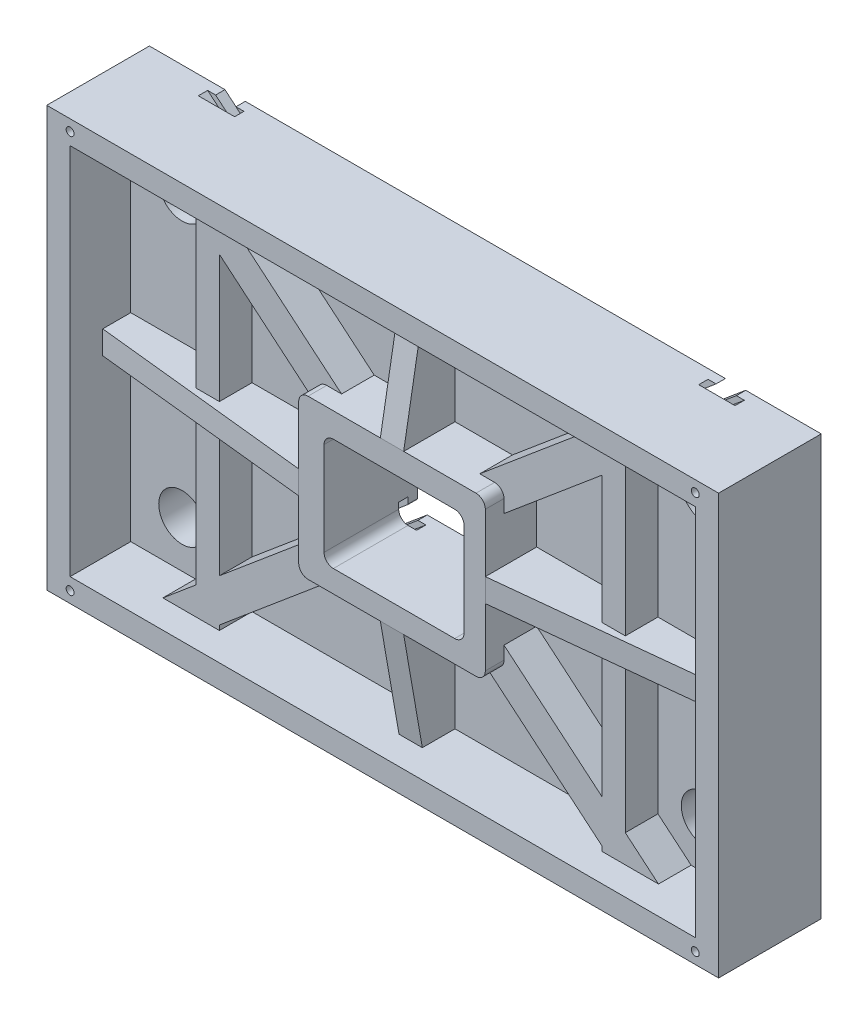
from build123d import *

# Parameters (mm, degrees)
SKETCH_1_W               = 720
SKETCH_1_H               = 450
SKETCH_1_R               = 25
EXTRUDE_1_DEPTH          = 110
SKETCH_2_W               = 670
SKETCH_2_H               = 400
CUT_EXTRUDE_1_DEPTH      = 65
EXTRUDE_2_DEPTH          = 55
EXTRUDE_3_DEPTH          = 12.5
EXTRUDE_3_DEPTH_BACK     = 12.5
EXTRUDE_4_DEPTH          = 12.5
EXTRUDE_4_DEPTH_BACK     = 12.5
SKETCH_7_W               = 35
SKETCH_7_H               = 187.5
EXTRUDE_5_DEPTH          = 25
SKETCH_8_W               = 35
SKETCH_8_H               = 187.5
EXTRUDE_6_DEPTH          = 25
CUT_EXTRUDE_2_DEPTH      = 413
CUT_EXTRUDE_2_DEPTH_BACK = 370
CUT_EXTRUDE_3_DEPTH      = 370
CUT_EXTRUDE_3_DEPTH_BACK = 370
EXTRUDE_7_DEPTH          = 35
HOLE_WIZARD_M10_1_D      = 8.5
HOLE_WIZARD_M10_1_DEPTH  = 24.5
HOLE_WIZARD_M10_1_TIP    = 2.553657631


with BuildPart() as part:
    # Sketch 1 → Extrude 1 (new body)
    with BuildSketch(Plane.XY):
        Rectangle(SKETCH_1_W, SKETCH_1_H)
        with Locations((280, -150)):
            Circle(SKETCH_1_R, mode=Mode.SUBTRACT)
        with Locations(Location((280, 150, 0), (0, 0, 180))):
            Circle(SKETCH_1_R, mode=Mode.SUBTRACT)
        with Locations(Location((-280, -150, 0), (0, 0, 180))):
            Circle(SKETCH_1_R, mode=Mode.SUBTRACT)
        with Locations((-280, 150)):
            Circle(SKETCH_1_R, mode=Mode.SUBTRACT)
        with BuildLine():
            Line((67.162817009, 58.648239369), (-62.837182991, 58.648239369))
            ThreePointArc((-62.837182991, 58.648239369), (-69.908250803, 55.719307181), (-72.837182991, 48.648239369))
            Line((-72.837182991, 48.648239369), (-72.837182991, -51.351760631))
            ThreePointArc((-72.837182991, -51.351760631), (-69.908250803, -58.422828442), (-62.837182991, -61.351760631))
            Line((-62.837182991, -61.351760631), (67.162817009, -61.351760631))
            ThreePointArc((67.162817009, -61.351760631), (74.233884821, -58.422828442), (77.162817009, -51.351760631))
            Line((77.162817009, -51.351760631), (77.162817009, 48.648239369))
            ThreePointArc((77.162817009, 48.648239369), (74.233884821, 55.719307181), (67.162817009, 58.648239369))
        make_face(mode=Mode.SUBTRACT)
    extrude(amount=EXTRUDE_1_DEPTH)

    # Sketch 2 → Cut-Extrude 1 (cut)
    with BuildSketch(Plane.XY.offset(110)):
        Rectangle(SKETCH_2_W, SKETCH_2_H)
    extrude(amount=-CUT_EXTRUDE_1_DEPTH, mode=Mode.SUBTRACT)

    # Sketch 3 → Extrude 2 (add)
    with BuildSketch(Plane.XY.offset(45)):
        with BuildLine():
            Line((90, 85), (-90, 85))
            ThreePointArc((-90, 85), (-97.071067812, 82.071067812), (-100, 75))
            Line((-100, 75), (-100, -75))
            ThreePointArc((-100, -75), (-97.071067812, -82.071067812), (-90, -85))
            Line((-90, -85), (90, -85))
            ThreePointArc((90, -85), (97.071067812, -82.071067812), (100, -75))
            Line((100, -75), (100, 75))
            ThreePointArc((100, 75), (97.071067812, 82.071067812), (90, 85))
        make_face()
        with BuildLine():
            Line((77.162817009, 48.648239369), (77.162817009, -51.351760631))
            ThreePointArc((77.162817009, -51.351760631), (74.233884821, -58.422828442), (67.162817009, -61.351760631))
            Line((67.162817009, -61.351760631), (-62.837182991, -61.351760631))
            ThreePointArc((-62.837182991, -61.351760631), (-69.908250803, -58.422828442), (-72.837182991, -51.351760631))
            Line((-72.837182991, -51.351760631), (-72.837182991, 48.648239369))
            ThreePointArc((-72.837182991, 48.648239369), (-69.908250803, 55.719307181), (-62.837182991, 58.648239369))
            Line((-62.837182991, 58.648239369), (67.162817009, 58.648239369))
            ThreePointArc((67.162817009, 58.648239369), (74.233884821, 55.719307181), (77.162817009, 48.648239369))
        make_face(mode=Mode.SUBTRACT)
    extrude(amount=EXTRUDE_2_DEPTH)

    # Sketch 5 → Extrude 3 (add, two sides: drawn at the far end of the back side and taken through both)
    with BuildSketch(Plane(origin=(0, 0, 0), x_dir=(1, 0, 0), z_dir=(0, 1, 0)).offset(-EXTRUDE_3_DEPTH_BACK)):
        Polygon((-335, -45), (-335, -75), (-100, -100), (-100, -45), align=None)
        Polygon((335, -45), (335, -75), (100, -100), (100, -45), align=None)
    extrude(amount=EXTRUDE_3_DEPTH + EXTRUDE_3_DEPTH_BACK)

    # Sketch 6 → Extrude 4 (add, two sides: drawn at the far end of the back side and taken through both)
    with BuildSketch(Plane(origin=(0, 0, 0), x_dir=(0, 0, -1), z_dir=(1, 0, 0)).offset(-EXTRUDE_4_DEPTH_BACK)):
        Polygon((-100, -85), (-45, -85), (-45, -200), (-80, -200), align=None)
        Polygon((-100, 85), (-45, 85), (-45, 200), (-80, 200), align=None)
    extrude(amount=EXTRUDE_4_DEPTH + EXTRUDE_4_DEPTH_BACK)

    # Sketch 7 → Extrude 5 (add)
    with BuildSketch(Plane.ZY.offset(205)):
        with Locations((62.5, 106.25)):
            Rectangle(SKETCH_7_W, SKETCH_7_H)
        with Locations((62.5, -106.25)):
            Rectangle(SKETCH_7_W, SKETCH_7_H)
    extrude(amount=EXTRUDE_5_DEPTH)

    # Sketch 8 → Extrude 6 (add)
    with BuildSketch(Plane(origin=(205, 0, 0), x_dir=(0, 0, -1), z_dir=(1, 0, 0))):
        with Locations((-62.5, 106.25)):
            Rectangle(SKETCH_8_W, SKETCH_8_H)
        with Locations((-62.5, -106.25)):
            Rectangle(SKETCH_8_W, SKETCH_8_H)
    extrude(amount=EXTRUDE_6_DEPTH)

    # Sketch 10 → Cut-Extrude 2 (cut, two sides: drawn at the far end of the back side and taken through both)
    with BuildSketch(Plane(origin=(0, 0, 0), x_dir=(0, 0, -1), z_dir=(0.7660444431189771, -0.6427876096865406, 0)).offset(-CUT_EXTRUDE_2_DEPTH_BACK)):
        Polygon((0, 7), (0, -7), (-10, -7), (-10, -12.5), (-20, -12.5), (-20, 12.5), (-10, 12.5), (-10, 7), align=None)
    extrude(amount=CUT_EXTRUDE_2_DEPTH + CUT_EXTRUDE_2_DEPTH_BACK, mode=Mode.SUBTRACT)

    # Sketch 11 → Cut-Extrude 3 (cut, two sides: drawn at the far end of the back side and taken through both)
    with BuildSketch(Plane(origin=(0, 0, 0), x_dir=(0, 0, 1), z_dir=(-0.7660444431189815, -0.6427876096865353, 0)).offset(-CUT_EXTRUDE_3_DEPTH_BACK)):
        Polygon((0, -7), (0, 7), (10, 7), (10, 12.5), (20, 12.5), (20, -12.5), (10, -12.5), (10, -7), align=None)
    extrude(amount=CUT_EXTRUDE_3_DEPTH + CUT_EXTRUDE_3_DEPTH_BACK, mode=Mode.SUBTRACT)

    # Sketch 12 → Extrude 7 (add)
    with BuildSketch(Plane.XY.offset(45)):
        with BuildLine():
            Line((211.125551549, -200), (265.575885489, -200))
            Line((265.575885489, -200), (100, -61.065335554))
            Line((100, -61.065335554), (100, -75))
            ThreePointArc((100, -75), (97.071067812, -82.071067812), (90, -85))
            Line((90, -85), (74.0738884, -85))
            Line((74.0738884, -85), (211.125551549, -200))
        make_face()
        with BuildLine():
            Line((-211.125551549, 200), (-265.575885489, 200))
            Line((-265.575885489, 200), (-100, 61.065335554))
            Line((-100, 61.065335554), (-100, 75))
            ThreePointArc((-100, 75), (-97.071067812, 82.071067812), (-90, 85))
            Line((-90, 85), (-74.0738884, 85))
            Line((-74.0738884, 85), (-211.125551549, 200))
        make_face()
        with BuildLine():
            Line((211.125551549, 200), (74.0738884, 85))
            Line((74.0738884, 85), (90, 85))
            ThreePointArc((90, 85), (97.071067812, 82.071067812), (100, 75))
            Line((100, 75), (100, 61.065335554))
            Line((100, 61.065335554), (265.575885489, 200))
            Line((265.575885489, 200), (211.125551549, 200))
        make_face()
        with BuildLine():
            Line((-265.575885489, -200), (-211.125551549, -200))
            Line((-211.125551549, -200), (-74.0738884, -85))
            Line((-74.0738884, -85), (-90, -85))
            ThreePointArc((-90, -85), (-97.071067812, -82.071067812), (-100, -75))
            Line((-100, -75), (-100, -61.065335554))
            Line((-100, -61.065335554), (-265.575885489, -200))
        make_face()
    extrude(amount=EXTRUDE_7_DEPTH)

    # Hole Wizard M10 _1
    with Locations(Plane.XY.offset(110)):
        with Locations((-335, -213), (-335, 213), (335, 213), (335, -213)):
            Hole(HOLE_WIZARD_M10_1_D / 2, depth=HOLE_WIZARD_M10_1_DEPTH)
            with Locations((0, 0, -(HOLE_WIZARD_M10_1_DEPTH + HOLE_WIZARD_M10_1_TIP / 2))):  # 118° drill point
                Cone(0, HOLE_WIZARD_M10_1_D / 2, HOLE_WIZARD_M10_1_TIP, mode=Mode.SUBTRACT)


solid = part.part
